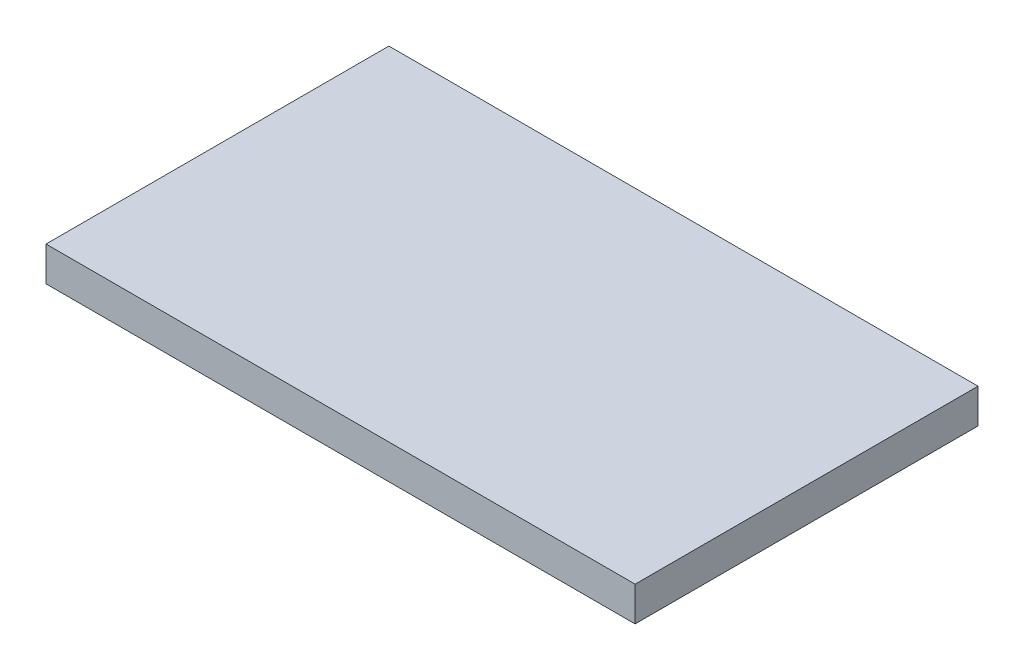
ISO-10303-21;
HEADER;
FILE_DESCRIPTION(('STEP AP214'),'2;1');
FILE_NAME('part.step','',(''),(''),'','','');
FILE_SCHEMA(('AUTOMOTIVE_DESIGN { 1 0 10303 214 1 1 1 1 }'));
ENDSEC;
DATA;
#1=APPLICATION_CONTEXT('core data for automotive mechanical design processes');
#2=APPLICATION_PROTOCOL_DEFINITION('international standard','automotive_design',2000,#1);
#3=PRODUCT_CONTEXT('',#1,'mechanical');
#4=PRODUCT('Part','Part','',(#3));
#5=PRODUCT_RELATED_PRODUCT_CATEGORY('part','',(#4));
#6=PRODUCT_DEFINITION_FORMATION('','',#4);
#7=PRODUCT_DEFINITION_CONTEXT('part definition',#1,'design');
#8=PRODUCT_DEFINITION('design','',#6,#7);
#9=PRODUCT_DEFINITION_SHAPE('','',#8);
#10=(LENGTH_UNIT() NAMED_UNIT(*) SI_UNIT(.MILLI.,.METRE.));
#11=(NAMED_UNIT(*) PLANE_ANGLE_UNIT() SI_UNIT($,.RADIAN.));
#12=(NAMED_UNIT(*) SI_UNIT($,.STERADIAN.) SOLID_ANGLE_UNIT());
#13=UNCERTAINTY_MEASURE_WITH_UNIT(LENGTH_MEASURE(1.E-05),#10,'distance_accuracy_value','');
#14=(GEOMETRIC_REPRESENTATION_CONTEXT(3) GLOBAL_UNCERTAINTY_ASSIGNED_CONTEXT((#13)) GLOBAL_UNIT_ASSIGNED_CONTEXT((#10,
#11,#12)) REPRESENTATION_CONTEXT('',''));
#15=CARTESIAN_POINT('',(0.,0.,0.));
#16=DIRECTION('',(0.,0.,1.));
#17=DIRECTION('',(1.,0.,0.));
#18=AXIS2_PLACEMENT_3D('',#15,#16,#17);
#19=CARTESIAN_POINT('',(-83.5955823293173,10.,-51.8030789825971));
#20=DIRECTION('',(1.,0.,0.));
#21=DIRECTION('',(0.,0.,-1.));
#22=AXIS2_PLACEMENT_3D('',#19,#20,#21);
#23=PLANE('',#22);
#24=DIRECTION('',(0.,0.,1.));
#25=VECTOR('',#24,1.);
#26=CARTESIAN_POINT('',(-83.5955823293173,0.,-51.8030789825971));
#27=LINE('',#26,#25);
#28=CARTESIAN_POINT('',(-83.5955823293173,0.,-51.8030789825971));
#29=VERTEX_POINT('',#28);
#30=CARTESIAN_POINT('',(-83.5955823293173,0.,47.6887550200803));
#31=VERTEX_POINT('',#30);
#32=EDGE_CURVE('E70',#29,#31,#27,.T.);
#33=ORIENTED_EDGE('',*,*,#32,.T.);
#34=DIRECTION('',(0.,-1.,0.));
#35=VECTOR('',#34,1.);
#36=CARTESIAN_POINT('',(-83.5955823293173,10.,47.6887550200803));
#37=LINE('',#36,#35);
#38=CARTESIAN_POINT('',(-83.5955823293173,10.,47.6887550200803));
#39=VERTEX_POINT('',#38);
#40=EDGE_CURVE('E11',#39,#31,#37,.T.);
#41=ORIENTED_EDGE('',*,*,#40,.F.);
#42=DIRECTION('',(0.,0.,1.));
#43=VECTOR('',#42,1.);
#44=CARTESIAN_POINT('',(-83.5955823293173,10.,-51.8030789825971));
#45=LINE('',#44,#43);
#46=CARTESIAN_POINT('',(-83.5955823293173,10.,-51.8030789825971));
#47=VERTEX_POINT('',#46);
#48=EDGE_CURVE('E88',#47,#39,#45,.T.);
#49=ORIENTED_EDGE('',*,*,#48,.F.);
#50=DIRECTION('',(0.,-1.,0.));
#51=VECTOR('',#50,1.);
#52=CARTESIAN_POINT('',(-83.5955823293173,10.,-51.8030789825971));
#53=LINE('',#52,#51);
#54=EDGE_CURVE('E82',#47,#29,#53,.T.);
#55=ORIENTED_EDGE('',*,*,#54,.T.);
#56=EDGE_LOOP('',(#33,#41,#49,#55));
#57=FACE_BOUND('',#56,.T.);
#58=ADVANCED_FACE('F26',(#57),#23,.F.);
#59=CARTESIAN_POINT('',(-83.5955823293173,10.,47.6887550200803));
#60=DIRECTION('',(0.,0.,-1.));
#61=DIRECTION('',(-1.,0.,0.));
#62=AXIS2_PLACEMENT_3D('',#59,#60,#61);
#63=PLANE('',#62);
#64=DIRECTION('',(1.,0.,0.));
#65=VECTOR('',#64,1.);
#66=CARTESIAN_POINT('',(-83.5955823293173,0.,47.6887550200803));
#67=LINE('',#66,#65);
#68=CARTESIAN_POINT('',(87.3358768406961,0.,47.6887550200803));
#69=VERTEX_POINT('',#68);
#70=EDGE_CURVE('E66',#31,#69,#67,.T.);
#71=ORIENTED_EDGE('',*,*,#70,.T.);
#72=DIRECTION('',(0.,-1.,0.));
#73=VECTOR('',#72,1.);
#74=CARTESIAN_POINT('',(87.3358768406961,10.,47.6887550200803));
#75=LINE('',#74,#73);
#76=CARTESIAN_POINT('',(87.3358768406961,10.,47.6887550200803));
#77=VERTEX_POINT('',#76);
#78=EDGE_CURVE('E33',#77,#69,#75,.T.);
#79=ORIENTED_EDGE('',*,*,#78,.F.);
#80=DIRECTION('',(1.,0.,0.));
#81=VECTOR('',#80,1.);
#82=CARTESIAN_POINT('',(-83.5955823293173,10.,47.6887550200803));
#83=LINE('',#82,#81);
#84=EDGE_CURVE('E78',#39,#77,#83,.T.);
#85=ORIENTED_EDGE('',*,*,#84,.F.);
#86=ORIENTED_EDGE('',*,*,#40,.T.);
#87=EDGE_LOOP('',(#71,#79,#85,#86));
#88=FACE_BOUND('',#87,.T.);
#89=ADVANCED_FACE('F77',(#88),#63,.F.);
#90=CARTESIAN_POINT('',(87.3358768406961,10.,-51.8030789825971));
#91=DIRECTION('',(-1.,0.,0.));
#92=DIRECTION('',(0.,0.,1.));
#93=AXIS2_PLACEMENT_3D('',#90,#91,#92);
#94=PLANE('',#93);
#95=DIRECTION('',(0.,0.,-1.));
#96=VECTOR('',#95,1.);
#97=CARTESIAN_POINT('',(87.3358768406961,0.,-51.8030789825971));
#98=LINE('',#97,#96);
#99=CARTESIAN_POINT('',(87.3358768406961,0.,-51.8030789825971));
#100=VERTEX_POINT('',#99);
#101=EDGE_CURVE('E71',#69,#100,#98,.T.);
#102=ORIENTED_EDGE('',*,*,#101,.T.);
#103=DIRECTION('',(0.,-1.,0.));
#104=VECTOR('',#103,1.);
#105=CARTESIAN_POINT('',(87.3358768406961,10.,-51.8030789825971));
#106=LINE('',#105,#104);
#107=CARTESIAN_POINT('',(87.3358768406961,10.,-51.8030789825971));
#108=VERTEX_POINT('',#107);
#109=EDGE_CURVE('E94',#108,#100,#106,.T.);
#110=ORIENTED_EDGE('',*,*,#109,.F.);
#111=DIRECTION('',(0.,0.,-1.));
#112=VECTOR('',#111,1.);
#113=CARTESIAN_POINT('',(87.3358768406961,10.,-51.8030789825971));
#114=LINE('',#113,#112);
#115=EDGE_CURVE('E45',#77,#108,#114,.T.);
#116=ORIENTED_EDGE('',*,*,#115,.F.);
#117=ORIENTED_EDGE('',*,*,#78,.T.);
#118=EDGE_LOOP('',(#102,#110,#116,#117));
#119=FACE_BOUND('',#118,.T.);
#120=ADVANCED_FACE('F97',(#119),#94,.F.);
#121=CARTESIAN_POINT('',(-83.5955823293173,10.,-51.8030789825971));
#122=DIRECTION('',(0.,0.,1.));
#123=DIRECTION('',(1.,0.,0.));
#124=AXIS2_PLACEMENT_3D('',#121,#122,#123);
#125=PLANE('',#124);
#126=DIRECTION('',(-1.,0.,0.));
#127=VECTOR('',#126,1.);
#128=CARTESIAN_POINT('',(-83.5955823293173,0.,-51.8030789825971));
#129=LINE('',#128,#127);
#130=EDGE_CURVE('E86',#100,#29,#129,.T.);
#131=ORIENTED_EDGE('',*,*,#130,.T.);
#132=ORIENTED_EDGE('',*,*,#54,.F.);
#133=DIRECTION('',(-1.,0.,0.));
#134=VECTOR('',#133,1.);
#135=CARTESIAN_POINT('',(-83.5955823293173,10.,-51.8030789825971));
#136=LINE('',#135,#134);
#137=EDGE_CURVE('E40',#108,#47,#136,.T.);
#138=ORIENTED_EDGE('',*,*,#137,.F.);
#139=ORIENTED_EDGE('',*,*,#109,.T.);
#140=EDGE_LOOP('',(#131,#132,#138,#139));
#141=FACE_BOUND('',#140,.T.);
#142=ADVANCED_FACE('F99',(#141),#125,.F.);
#143=CARTESIAN_POINT('',(-83.5955823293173,10.,47.6887550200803));
#144=DIRECTION('',(0.,1.,0.));
#145=DIRECTION('',(0.,0.,1.));
#146=AXIS2_PLACEMENT_3D('',#143,#144,#145);
#147=PLANE('',#146);
#148=ORIENTED_EDGE('',*,*,#48,.T.);
#149=ORIENTED_EDGE('',*,*,#84,.T.);
#150=ORIENTED_EDGE('',*,*,#115,.T.);
#151=ORIENTED_EDGE('',*,*,#137,.T.);
#152=EDGE_LOOP('',(#148,#149,#150,#151));
#153=FACE_BOUND('',#152,.T.);
#154=ADVANCED_FACE('F100',(#153),#147,.T.);
#155=CARTESIAN_POINT('',(-83.5955823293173,0.,47.6887550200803));
#156=DIRECTION('',(0.,1.,0.));
#157=DIRECTION('',(0.,0.,1.));
#158=AXIS2_PLACEMENT_3D('',#155,#156,#157);
#159=PLANE('',#158);
#160=ORIENTED_EDGE('',*,*,#32,.F.);
#161=ORIENTED_EDGE('',*,*,#130,.F.);
#162=ORIENTED_EDGE('',*,*,#101,.F.);
#163=ORIENTED_EDGE('',*,*,#70,.F.);
#164=EDGE_LOOP('',(#160,#161,#162,#163));
#165=FACE_BOUND('',#164,.T.);
#166=ADVANCED_FACE('F67',(#165),#159,.F.);
#167=CLOSED_SHELL('',(#58,#89,#120,#142,#154,#166));
#168=MANIFOLD_SOLID_BREP('B2',#167);
#169=ADVANCED_BREP_SHAPE_REPRESENTATION('',(#18,#168),#14);
#170=SHAPE_DEFINITION_REPRESENTATION(#9,#169);
ENDSEC;
END-ISO-10303-21;
